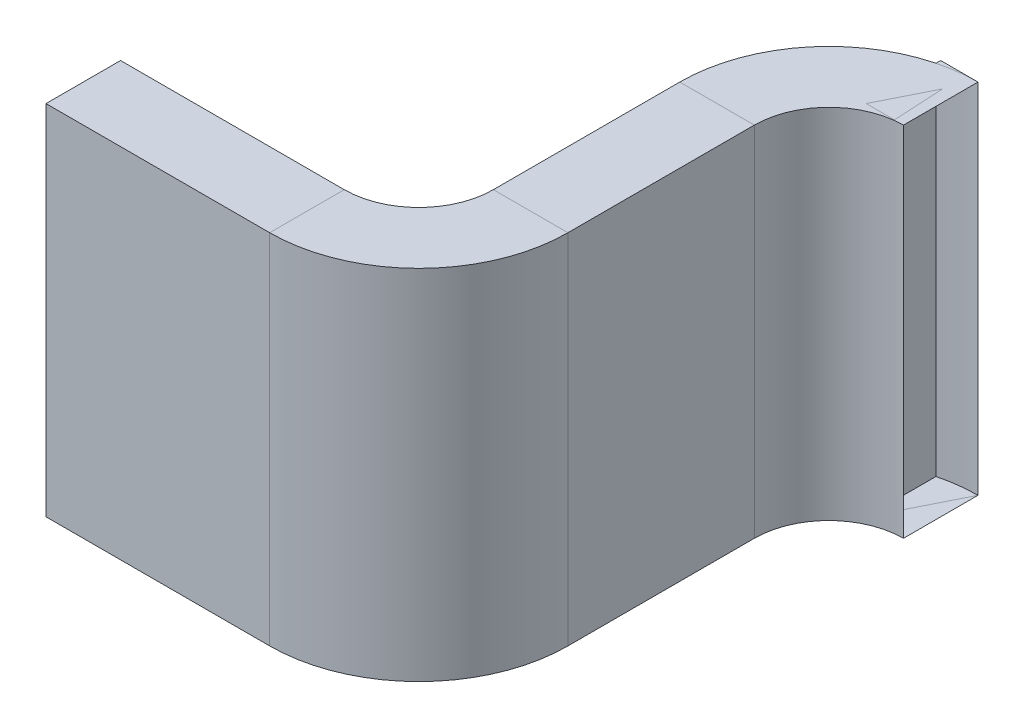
ISO-10303-21;
HEADER;
FILE_DESCRIPTION(('STEP AP214'),'2;1');
FILE_NAME('part.step','',(''),(''),'','','');
FILE_SCHEMA(('AUTOMOTIVE_DESIGN { 1 0 10303 214 1 1 1 1 }'));
ENDSEC;
DATA;
#1=APPLICATION_CONTEXT('core data for automotive mechanical design processes');
#2=APPLICATION_PROTOCOL_DEFINITION('international standard','automotive_design',2000,#1);
#3=PRODUCT_CONTEXT('',#1,'mechanical');
#4=PRODUCT('Part','Part','',(#3));
#5=PRODUCT_RELATED_PRODUCT_CATEGORY('part','',(#4));
#6=PRODUCT_DEFINITION_FORMATION('','',#4);
#7=PRODUCT_DEFINITION_CONTEXT('part definition',#1,'design');
#8=PRODUCT_DEFINITION('design','',#6,#7);
#9=PRODUCT_DEFINITION_SHAPE('','',#8);
#10=(LENGTH_UNIT() NAMED_UNIT(*) SI_UNIT(.MILLI.,.METRE.));
#11=(NAMED_UNIT(*) PLANE_ANGLE_UNIT() SI_UNIT($,.RADIAN.));
#12=(NAMED_UNIT(*) SI_UNIT($,.STERADIAN.) SOLID_ANGLE_UNIT());
#13=UNCERTAINTY_MEASURE_WITH_UNIT(LENGTH_MEASURE(1.E-05),#10,'distance_accuracy_value','');
#14=(GEOMETRIC_REPRESENTATION_CONTEXT(3) GLOBAL_UNCERTAINTY_ASSIGNED_CONTEXT((#13)) GLOBAL_UNIT_ASSIGNED_CONTEXT((#10,
#11,#12)) REPRESENTATION_CONTEXT('',''));
#15=CARTESIAN_POINT('',(0.,0.,0.));
#16=DIRECTION('',(0.,0.,1.));
#17=DIRECTION('',(1.,0.,0.));
#18=AXIS2_PLACEMENT_3D('',#15,#16,#17);
#19=CARTESIAN_POINT('',(0.55,-0.24,0.));
#20=DIRECTION('',(-1.,0.,0.));
#21=DIRECTION('',(0.,1.,0.));
#22=AXIS2_PLACEMENT_3D('',#19,#20,#21);
#23=PLANE('',#22);
#24=DIRECTION('',(0.,-1.,0.));
#25=VECTOR('',#24,1.);
#26=CARTESIAN_POINT('',(0.55,-0.24,0.));
#27=LINE('',#26,#25);
#28=CARTESIAN_POINT('',(0.55,0.24,0.));
#29=VERTEX_POINT('',#28);
#30=CARTESIAN_POINT('',(0.55,-0.24,0.));
#31=VERTEX_POINT('',#30);
#32=EDGE_CURVE('E183',#29,#31,#27,.T.);
#33=ORIENTED_EDGE('',*,*,#32,.F.);
#34=DIRECTION('',(0.,0.,-1.));
#35=VECTOR('',#34,1.);
#36=CARTESIAN_POINT('',(0.55,0.24,0.));
#37=LINE('',#36,#35);
#38=CARTESIAN_POINT('',(0.55,0.24,0.1));
#39=VERTEX_POINT('',#38);
#40=EDGE_CURVE('E11',#39,#29,#37,.T.);
#41=ORIENTED_EDGE('',*,*,#40,.F.);
#42=DIRECTION('',(0.,1.,0.));
#43=VECTOR('',#42,1.);
#44=CARTESIAN_POINT('',(0.55,0.24,0.1));
#45=LINE('',#44,#43);
#46=CARTESIAN_POINT('',(0.55,-0.24,0.1));
#47=VERTEX_POINT('',#46);
#48=EDGE_CURVE('E289',#47,#39,#45,.T.);
#49=ORIENTED_EDGE('',*,*,#48,.F.);
#50=DIRECTION('',(0.,0.,1.));
#51=VECTOR('',#50,1.);
#52=CARTESIAN_POINT('',(0.55,-0.24,0.1));
#53=LINE('',#52,#51);
#54=EDGE_CURVE('E222',#31,#47,#53,.T.);
#55=ORIENTED_EDGE('',*,*,#54,.F.);
#56=EDGE_LOOP('',(#33,#41,#49,#55));
#57=FACE_BOUND('',#56,.T.);
#58=ADVANCED_FACE('F17',(#57),#23,.F.);
#59=CARTESIAN_POINT('',(0.6,0.24,0.));
#60=DIRECTION('',(0.,1.,0.));
#61=DIRECTION('',(1.,0.,0.));
#62=AXIS2_PLACEMENT_3D('',#59,#60,#61);
#63=PLANE('',#62);
#64=ORIENTED_EDGE('',*,*,#40,.T.);
#65=DIRECTION('',(-1.,0.,0.));
#66=VECTOR('',#65,1.);
#67=CARTESIAN_POINT('',(0.6,0.24,0.));
#68=LINE('',#67,#66);
#69=CARTESIAN_POINT('',(0.6,0.24,0.));
#70=VERTEX_POINT('',#69);
#71=EDGE_CURVE('E229',#70,#29,#68,.T.);
#72=ORIENTED_EDGE('',*,*,#71,.F.);
#73=DIRECTION('',(0.,0.,-1.));
#74=VECTOR('',#73,1.);
#75=CARTESIAN_POINT('',(0.6,0.24,0.));
#76=LINE('',#75,#74);
#77=CARTESIAN_POINT('',(0.6,0.24,0.1));
#78=VERTEX_POINT('',#77);
#79=EDGE_CURVE('E25',#78,#70,#76,.T.);
#80=ORIENTED_EDGE('',*,*,#79,.F.);
#81=DIRECTION('',(-1.,0.,0.));
#82=VECTOR('',#81,1.);
#83=CARTESIAN_POINT('',(0.6,0.24,0.1));
#84=LINE('',#83,#82);
#85=EDGE_CURVE('E175',#78,#39,#84,.T.);
#86=ORIENTED_EDGE('',*,*,#85,.T.);
#87=EDGE_LOOP('',(#64,#72,#80,#86));
#88=FACE_BOUND('',#87,.T.);
#89=ADVANCED_FACE('F308',(#88),#63,.F.);
#90=CARTESIAN_POINT('',(0.493933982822,0.24,0.09393398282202));
#91=DIRECTION('',(0.,1.,0.));
#92=DIRECTION('',(1.,0.,0.));
#93=AXIS2_PLACEMENT_3D('',#90,#91,#92);
#94=PLANE('',#93);
#95=CARTESIAN_POINT('',(0.6,0.24,0.2));
#96=DIRECTION('',(0.,-1.,0.));
#97=DIRECTION('',(0.,0.,-1.));
#98=AXIS2_PLACEMENT_3D('',#95,#96,#97);
#99=CIRCLE('',#98,0.1);
#100=CARTESIAN_POINT('',(0.5,0.24,0.2));
#101=VERTEX_POINT('',#100);
#102=EDGE_CURVE('E285',#101,#78,#99,.T.);
#103=ORIENTED_EDGE('',*,*,#102,.T.);
#104=ORIENTED_EDGE('',*,*,#79,.T.);
#105=CARTESIAN_POINT('',(0.6,0.24,0.2));
#106=DIRECTION('',(0.,-1.,0.));
#107=DIRECTION('',(0.,0.,-1.));
#108=AXIS2_PLACEMENT_3D('',#105,#106,#107);
#109=CIRCLE('',#108,0.2);
#110=CARTESIAN_POINT('',(0.4,0.24,0.2));
#111=VERTEX_POINT('',#110);
#112=EDGE_CURVE('E189',#111,#70,#109,.T.);
#113=ORIENTED_EDGE('',*,*,#112,.F.);
#114=DIRECTION('',(-1.,0.,0.));
#115=VECTOR('',#114,1.);
#116=CARTESIAN_POINT('',(0.4,0.24,0.2));
#117=LINE('',#116,#115);
#118=EDGE_CURVE('E297',#101,#111,#117,.T.);
#119=ORIENTED_EDGE('',*,*,#118,.F.);
#120=EDGE_LOOP('',(#103,#104,#113,#119));
#121=FACE_BOUND('',#120,.T.);
#122=ADVANCED_FACE('F304',(#121),#94,.T.);
#123=CARTESIAN_POINT('',(0.4,0.24,0.45));
#124=DIRECTION('',(0.,-1.,0.));
#125=DIRECTION('',(0.,0.,-1.));
#126=AXIS2_PLACEMENT_3D('',#123,#124,#125);
#127=PLANE('',#126);
#128=ORIENTED_EDGE('',*,*,#118,.T.);
#129=DIRECTION('',(0.,0.,-1.));
#130=VECTOR('',#129,1.);
#131=CARTESIAN_POINT('',(0.4,0.24,0.45));
#132=LINE('',#131,#130);
#133=CARTESIAN_POINT('',(0.4,0.24,0.45));
#134=VERTEX_POINT('',#133);
#135=EDGE_CURVE('E194',#134,#111,#132,.T.);
#136=ORIENTED_EDGE('',*,*,#135,.F.);
#137=DIRECTION('',(-1.,0.,0.));
#138=VECTOR('',#137,1.);
#139=CARTESIAN_POINT('',(0.4,0.24,0.45));
#140=LINE('',#139,#138);
#141=CARTESIAN_POINT('',(0.5,0.24,0.45));
#142=VERTEX_POINT('',#141);
#143=EDGE_CURVE('E174',#142,#134,#140,.T.);
#144=ORIENTED_EDGE('',*,*,#143,.F.);
#145=DIRECTION('',(0.,0.,-1.));
#146=VECTOR('',#145,1.);
#147=CARTESIAN_POINT('',(0.5,0.24,0.45));
#148=LINE('',#147,#146);
#149=EDGE_CURVE('E278',#142,#101,#148,.T.);
#150=ORIENTED_EDGE('',*,*,#149,.T.);
#151=EDGE_LOOP('',(#128,#136,#144,#150));
#152=FACE_BOUND('',#151,.T.);
#153=ADVANCED_FACE('F325',(#152),#127,.F.);
#154=CARTESIAN_POINT('',(0.406066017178,0.24,0.556066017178));
#155=DIRECTION('',(0.,1.,0.));
#156=DIRECTION('',(1.,0.,0.));
#157=AXIS2_PLACEMENT_3D('',#154,#155,#156);
#158=PLANE('',#157);
#159=CARTESIAN_POINT('',(0.3,0.24,0.45));
#160=DIRECTION('',(0.,1.,0.));
#161=DIRECTION('',(0.,0.,-1.));
#162=AXIS2_PLACEMENT_3D('',#159,#160,#161);
#163=CIRCLE('',#162,0.2);
#164=CARTESIAN_POINT('',(0.3,0.24,0.65));
#165=VERTEX_POINT('',#164);
#166=EDGE_CURVE('E270',#165,#142,#163,.T.);
#167=ORIENTED_EDGE('',*,*,#166,.T.);
#168=ORIENTED_EDGE('',*,*,#143,.T.);
#169=CARTESIAN_POINT('',(0.3,0.24,0.45));
#170=DIRECTION('',(0.,1.,0.));
#171=DIRECTION('',(0.,0.,-1.));
#172=AXIS2_PLACEMENT_3D('',#169,#170,#171);
#173=CIRCLE('',#172,0.1);
#174=CARTESIAN_POINT('',(0.3,0.24,0.55));
#175=VERTEX_POINT('',#174);
#176=EDGE_CURVE('E205',#175,#134,#173,.T.);
#177=ORIENTED_EDGE('',*,*,#176,.F.);
#178=DIRECTION('',(0.,0.,-1.));
#179=VECTOR('',#178,1.);
#180=CARTESIAN_POINT('',(0.3,0.24,0.55));
#181=LINE('',#180,#179);
#182=EDGE_CURVE('E171',#165,#175,#181,.T.);
#183=ORIENTED_EDGE('',*,*,#182,.F.);
#184=EDGE_LOOP('',(#167,#168,#177,#183));
#185=FACE_BOUND('',#184,.T.);
#186=ADVANCED_FACE('F332',(#185),#158,.T.);
#187=CARTESIAN_POINT('',(0.,0.24,0.55));
#188=DIRECTION('',(0.,-1.,0.));
#189=DIRECTION('',(0.,0.,-1.));
#190=AXIS2_PLACEMENT_3D('',#187,#188,#189);
#191=PLANE('',#190);
#192=ORIENTED_EDGE('',*,*,#182,.T.);
#193=DIRECTION('',(1.,0.,0.));
#194=VECTOR('',#193,1.);
#195=CARTESIAN_POINT('',(0.,0.24,0.55));
#196=LINE('',#195,#194);
#197=CARTESIAN_POINT('',(0.,0.24,0.55));
#198=VERTEX_POINT('',#197);
#199=EDGE_CURVE('E146',#198,#175,#196,.T.);
#200=ORIENTED_EDGE('',*,*,#199,.F.);
#201=DIRECTION('',(0.,0.,-1.));
#202=VECTOR('',#201,1.);
#203=CARTESIAN_POINT('',(0.,0.24,0.55));
#204=LINE('',#203,#202);
#205=CARTESIAN_POINT('',(0.,0.24,0.65));
#206=VERTEX_POINT('',#205);
#207=EDGE_CURVE('E154',#206,#198,#204,.T.);
#208=ORIENTED_EDGE('',*,*,#207,.F.);
#209=DIRECTION('',(1.,0.,0.));
#210=VECTOR('',#209,1.);
#211=CARTESIAN_POINT('',(0.,0.24,0.65));
#212=LINE('',#211,#210);
#213=EDGE_CURVE('E262',#206,#165,#212,.T.);
#214=ORIENTED_EDGE('',*,*,#213,.T.);
#215=EDGE_LOOP('',(#192,#200,#208,#214));
#216=FACE_BOUND('',#215,.T.);
#217=ADVANCED_FACE('F335',(#216),#191,.F.);
#218=CARTESIAN_POINT('',(0.6,0.24,0.1));
#219=DIRECTION('',(0.,0.,1.));
#220=DIRECTION('',(1.,0.,0.));
#221=AXIS2_PLACEMENT_3D('',#218,#219,#220);
#222=PLANE('',#221);
#223=ORIENTED_EDGE('',*,*,#48,.T.);
#224=ORIENTED_EDGE('',*,*,#85,.F.);
#225=DIRECTION('',(0.,-1.,0.));
#226=VECTOR('',#225,1.);
#227=CARTESIAN_POINT('',(0.6,0.24,0.1));
#228=LINE('',#227,#226);
#229=CARTESIAN_POINT('',(0.6,-0.24,0.1));
#230=VERTEX_POINT('',#229);
#231=EDGE_CURVE('E282',#78,#230,#228,.T.);
#232=ORIENTED_EDGE('',*,*,#231,.T.);
#233=DIRECTION('',(-1.,0.,0.));
#234=VECTOR('',#233,1.);
#235=CARTESIAN_POINT('',(0.6,-0.24,0.1));
#236=LINE('',#235,#234);
#237=EDGE_CURVE('E217',#230,#47,#236,.T.);
#238=ORIENTED_EDGE('',*,*,#237,.T.);
#239=EDGE_LOOP('',(#223,#224,#232,#238));
#240=FACE_BOUND('',#239,.T.);
#241=ADVANCED_FACE('F357',(#240),#222,.F.);
#242=CARTESIAN_POINT('',(0.6,0.24,0.2));
#243=DIRECTION('',(0.,-1.,0.));
#244=DIRECTION('',(0.,0.,-1.));
#245=AXIS2_PLACEMENT_3D('',#242,#243,#244);
#246=CYLINDRICAL_SURFACE('',#245,0.1);
#247=ORIENTED_EDGE('',*,*,#231,.F.);
#248=ORIENTED_EDGE('',*,*,#102,.F.);
#249=DIRECTION('',(0.,1.,0.));
#250=VECTOR('',#249,1.);
#251=CARTESIAN_POINT('',(0.5,0.24,0.2));
#252=LINE('',#251,#250);
#253=CARTESIAN_POINT('',(0.5,-0.24,0.2));
#254=VERTEX_POINT('',#253);
#255=EDGE_CURVE('E274',#254,#101,#252,.T.);
#256=ORIENTED_EDGE('',*,*,#255,.F.);
#257=CARTESIAN_POINT('',(0.6,-0.24,0.2));
#258=DIRECTION('',(0.,-1.,0.));
#259=DIRECTION('',(0.,0.,-1.));
#260=AXIS2_PLACEMENT_3D('',#257,#258,#259);
#261=CIRCLE('',#260,0.1);
#262=EDGE_CURVE('E252',#254,#230,#261,.T.);
#263=ORIENTED_EDGE('',*,*,#262,.T.);
#264=EDGE_LOOP('',(#247,#248,#256,#263));
#265=FACE_BOUND('',#264,.T.);
#266=ADVANCED_FACE('F350',(#265),#246,.F.);
#267=CARTESIAN_POINT('',(0.5,0.24,0.45));
#268=DIRECTION('',(-1.,0.,0.));
#269=DIRECTION('',(0.,0.,1.));
#270=AXIS2_PLACEMENT_3D('',#267,#268,#269);
#271=PLANE('',#270);
#272=ORIENTED_EDGE('',*,*,#255,.T.);
#273=ORIENTED_EDGE('',*,*,#149,.F.);
#274=DIRECTION('',(0.,1.,0.));
#275=VECTOR('',#274,1.);
#276=CARTESIAN_POINT('',(0.5,0.24,0.45));
#277=LINE('',#276,#275);
#278=CARTESIAN_POINT('',(0.5,-0.24,0.45));
#279=VERTEX_POINT('',#278);
#280=EDGE_CURVE('E266',#279,#142,#277,.T.);
#281=ORIENTED_EDGE('',*,*,#280,.F.);
#282=DIRECTION('',(0.,0.,-1.));
#283=VECTOR('',#282,1.);
#284=CARTESIAN_POINT('',(0.5,-0.24,0.45));
#285=LINE('',#284,#283);
#286=EDGE_CURVE('E195',#279,#254,#285,.T.);
#287=ORIENTED_EDGE('',*,*,#286,.T.);
#288=EDGE_LOOP('',(#272,#273,#281,#287));
#289=FACE_BOUND('',#288,.T.);
#290=ADVANCED_FACE('F347',(#289),#271,.F.);
#291=CARTESIAN_POINT('',(0.3,0.24,0.45));
#292=DIRECTION('',(0.,1.,0.));
#293=DIRECTION('',(0.,0.,-1.));
#294=AXIS2_PLACEMENT_3D('',#291,#292,#293);
#295=CYLINDRICAL_SURFACE('',#294,0.2);
#296=CARTESIAN_POINT('',(0.3,-0.24,0.45));
#297=DIRECTION('',(0.,1.,0.));
#298=DIRECTION('',(0.,0.,-1.));
#299=AXIS2_PLACEMENT_3D('',#296,#297,#298);
#300=CIRCLE('',#299,0.2);
#301=CARTESIAN_POINT('',(0.3,-0.24,0.65));
#302=VERTEX_POINT('',#301);
#303=EDGE_CURVE('E242',#302,#279,#300,.T.);
#304=ORIENTED_EDGE('',*,*,#303,.T.);
#305=ORIENTED_EDGE('',*,*,#280,.T.);
#306=ORIENTED_EDGE('',*,*,#166,.F.);
#307=DIRECTION('',(0.,1.,0.));
#308=VECTOR('',#307,1.);
#309=CARTESIAN_POINT('',(0.3,0.24,0.65));
#310=LINE('',#309,#308);
#311=EDGE_CURVE('E221',#302,#165,#310,.T.);
#312=ORIENTED_EDGE('',*,*,#311,.F.);
#313=EDGE_LOOP('',(#304,#305,#306,#312));
#314=FACE_BOUND('',#313,.T.);
#315=ADVANCED_FACE('F340',(#314),#295,.T.);
#316=CARTESIAN_POINT('',(0.,0.24,0.65));
#317=DIRECTION('',(0.,0.,-1.));
#318=DIRECTION('',(0.,-1.,0.));
#319=AXIS2_PLACEMENT_3D('',#316,#317,#318);
#320=PLANE('',#319);
#321=ORIENTED_EDGE('',*,*,#311,.T.);
#322=ORIENTED_EDGE('',*,*,#213,.F.);
#323=DIRECTION('',(0.,1.,0.));
#324=VECTOR('',#323,1.);
#325=CARTESIAN_POINT('',(0.,0.24,0.65));
#326=LINE('',#325,#324);
#327=CARTESIAN_POINT('',(0.,-0.24,0.65));
#328=VERTEX_POINT('',#327);
#329=EDGE_CURVE('E162',#328,#206,#326,.T.);
#330=ORIENTED_EDGE('',*,*,#329,.F.);
#331=DIRECTION('',(1.,0.,0.));
#332=VECTOR('',#331,1.);
#333=CARTESIAN_POINT('',(0.,-0.24,0.65));
#334=LINE('',#333,#332);
#335=EDGE_CURVE('E159',#328,#302,#334,.T.);
#336=ORIENTED_EDGE('',*,*,#335,.T.);
#337=EDGE_LOOP('',(#321,#322,#330,#336));
#338=FACE_BOUND('',#337,.T.);
#339=ADVANCED_FACE('F337',(#338),#320,.F.);
#340=CARTESIAN_POINT('',(0.6,-0.24,0.1));
#341=DIRECTION('',(0.,-1.,0.));
#342=DIRECTION('',(0.,0.,-1.));
#343=AXIS2_PLACEMENT_3D('',#340,#341,#342);
#344=PLANE('',#343);
#345=ORIENTED_EDGE('',*,*,#54,.T.);
#346=ORIENTED_EDGE('',*,*,#237,.F.);
#347=DIRECTION('',(0.,0.,1.));
#348=VECTOR('',#347,1.);
#349=CARTESIAN_POINT('',(0.6,-0.24,0.1));
#350=LINE('',#349,#348);
#351=CARTESIAN_POINT('',(0.6,-0.24,0.));
#352=VERTEX_POINT('',#351);
#353=EDGE_CURVE('E199',#352,#230,#350,.T.);
#354=ORIENTED_EDGE('',*,*,#353,.F.);
#355=DIRECTION('',(-1.,0.,0.));
#356=VECTOR('',#355,1.);
#357=CARTESIAN_POINT('',(0.6,-0.24,0.));
#358=LINE('',#357,#356);
#359=EDGE_CURVE('E186',#352,#31,#358,.T.);
#360=ORIENTED_EDGE('',*,*,#359,.T.);
#361=EDGE_LOOP('',(#345,#346,#354,#360));
#362=FACE_BOUND('',#361,.T.);
#363=ADVANCED_FACE('F355',(#362),#344,.F.);
#364=CARTESIAN_POINT('',(0.493933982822,-0.24,0.09393398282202));
#365=DIRECTION('',(0.,-1.,0.));
#366=DIRECTION('',(0.,0.,-1.));
#367=AXIS2_PLACEMENT_3D('',#364,#365,#366);
#368=PLANE('',#367);
#369=CARTESIAN_POINT('',(0.6,-0.24,0.2));
#370=DIRECTION('',(0.,-1.,0.));
#371=DIRECTION('',(0.,0.,-1.));
#372=AXIS2_PLACEMENT_3D('',#369,#370,#371);
#373=CIRCLE('',#372,0.2);
#374=CARTESIAN_POINT('',(0.4,-0.24,0.2));
#375=VERTEX_POINT('',#374);
#376=EDGE_CURVE('E187',#375,#352,#373,.T.);
#377=ORIENTED_EDGE('',*,*,#376,.T.);
#378=ORIENTED_EDGE('',*,*,#353,.T.);
#379=ORIENTED_EDGE('',*,*,#262,.F.);
#380=DIRECTION('',(1.,0.,0.));
#381=VECTOR('',#380,1.);
#382=CARTESIAN_POINT('',(0.5,-0.24,0.2));
#383=LINE('',#382,#381);
#384=EDGE_CURVE('E200',#375,#254,#383,.T.);
#385=ORIENTED_EDGE('',*,*,#384,.F.);
#386=EDGE_LOOP('',(#377,#378,#379,#385));
#387=FACE_BOUND('',#386,.T.);
#388=ADVANCED_FACE('F352',(#387),#368,.T.);
#389=CARTESIAN_POINT('',(0.5,-0.24,0.45));
#390=DIRECTION('',(0.,1.,0.));
#391=DIRECTION('',(1.,0.,0.));
#392=AXIS2_PLACEMENT_3D('',#389,#390,#391);
#393=PLANE('',#392);
#394=ORIENTED_EDGE('',*,*,#384,.T.);
#395=ORIENTED_EDGE('',*,*,#286,.F.);
#396=DIRECTION('',(1.,0.,0.));
#397=VECTOR('',#396,1.);
#398=CARTESIAN_POINT('',(0.5,-0.24,0.45));
#399=LINE('',#398,#397);
#400=CARTESIAN_POINT('',(0.4,-0.24,0.45));
#401=VERTEX_POINT('',#400);
#402=EDGE_CURVE('E238',#401,#279,#399,.T.);
#403=ORIENTED_EDGE('',*,*,#402,.F.);
#404=DIRECTION('',(0.,0.,-1.));
#405=VECTOR('',#404,1.);
#406=CARTESIAN_POINT('',(0.4,-0.24,0.45));
#407=LINE('',#406,#405);
#408=EDGE_CURVE('E216',#401,#375,#407,.T.);
#409=ORIENTED_EDGE('',*,*,#408,.T.);
#410=EDGE_LOOP('',(#394,#395,#403,#409));
#411=FACE_BOUND('',#410,.T.);
#412=ADVANCED_FACE('F345',(#411),#393,.F.);
#413=CARTESIAN_POINT('',(0.406066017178,-0.24,0.556066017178));
#414=DIRECTION('',(0.,-1.,0.));
#415=DIRECTION('',(0.,0.,-1.));
#416=AXIS2_PLACEMENT_3D('',#413,#414,#415);
#417=PLANE('',#416);
#418=CARTESIAN_POINT('',(0.3,-0.24,0.45));
#419=DIRECTION('',(0.,1.,0.));
#420=DIRECTION('',(0.,0.,-1.));
#421=AXIS2_PLACEMENT_3D('',#418,#419,#420);
#422=CIRCLE('',#421,0.1);
#423=CARTESIAN_POINT('',(0.3,-0.24,0.55));
#424=VERTEX_POINT('',#423);
#425=EDGE_CURVE('E204',#424,#401,#422,.T.);
#426=ORIENTED_EDGE('',*,*,#425,.T.);
#427=ORIENTED_EDGE('',*,*,#402,.T.);
#428=ORIENTED_EDGE('',*,*,#303,.F.);
#429=DIRECTION('',(0.,0.,1.));
#430=VECTOR('',#429,1.);
#431=CARTESIAN_POINT('',(0.3,-0.24,0.65));
#432=LINE('',#431,#430);
#433=EDGE_CURVE('E233',#424,#302,#432,.T.);
#434=ORIENTED_EDGE('',*,*,#433,.F.);
#435=EDGE_LOOP('',(#426,#427,#428,#434));
#436=FACE_BOUND('',#435,.T.);
#437=ADVANCED_FACE('F342',(#436),#417,.T.);
#438=CARTESIAN_POINT('',(0.,-0.24,0.65));
#439=DIRECTION('',(0.,1.,0.));
#440=DIRECTION('',(1.,0.,0.));
#441=AXIS2_PLACEMENT_3D('',#438,#439,#440);
#442=PLANE('',#441);
#443=ORIENTED_EDGE('',*,*,#433,.T.);
#444=ORIENTED_EDGE('',*,*,#335,.F.);
#445=DIRECTION('',(0.,0.,1.));
#446=VECTOR('',#445,1.);
#447=CARTESIAN_POINT('',(0.,-0.24,0.65));
#448=LINE('',#447,#446);
#449=CARTESIAN_POINT('',(0.,-0.24,0.55));
#450=VERTEX_POINT('',#449);
#451=EDGE_CURVE('E152',#450,#328,#448,.T.);
#452=ORIENTED_EDGE('',*,*,#451,.F.);
#453=DIRECTION('',(1.,0.,0.));
#454=VECTOR('',#453,1.);
#455=CARTESIAN_POINT('',(0.,-0.24,0.55));
#456=LINE('',#455,#454);
#457=EDGE_CURVE('E134',#450,#424,#456,.T.);
#458=ORIENTED_EDGE('',*,*,#457,.T.);
#459=EDGE_LOOP('',(#443,#444,#452,#458));
#460=FACE_BOUND('',#459,.T.);
#461=ADVANCED_FACE('F157',(#460),#442,.F.);
#462=CARTESIAN_POINT('',(0.6,-0.24,0.));
#463=DIRECTION('',(0.,0.,-1.));
#464=DIRECTION('',(0.,-1.,0.));
#465=AXIS2_PLACEMENT_3D('',#462,#463,#464);
#466=PLANE('',#465);
#467=ORIENTED_EDGE('',*,*,#32,.T.);
#468=ORIENTED_EDGE('',*,*,#359,.F.);
#469=DIRECTION('',(0.,-1.,0.));
#470=VECTOR('',#469,1.);
#471=CARTESIAN_POINT('',(0.6,-0.24,0.));
#472=LINE('',#471,#470);
#473=EDGE_CURVE('E193',#70,#352,#472,.T.);
#474=ORIENTED_EDGE('',*,*,#473,.F.);
#475=ORIENTED_EDGE('',*,*,#71,.T.);
#476=EDGE_LOOP('',(#467,#468,#474,#475));
#477=FACE_BOUND('',#476,.T.);
#478=ADVANCED_FACE('F311',(#477),#466,.F.);
#479=CARTESIAN_POINT('',(0.6,-0.24,0.2));
#480=DIRECTION('',(0.,-1.,0.));
#481=DIRECTION('',(0.,0.,-1.));
#482=AXIS2_PLACEMENT_3D('',#479,#480,#481);
#483=CYLINDRICAL_SURFACE('',#482,0.2);
#484=ORIENTED_EDGE('',*,*,#112,.T.);
#485=ORIENTED_EDGE('',*,*,#473,.T.);
#486=ORIENTED_EDGE('',*,*,#376,.F.);
#487=DIRECTION('',(0.,-1.,0.));
#488=VECTOR('',#487,1.);
#489=CARTESIAN_POINT('',(0.4,-0.24,0.2));
#490=LINE('',#489,#488);
#491=EDGE_CURVE('E209',#111,#375,#490,.T.);
#492=ORIENTED_EDGE('',*,*,#491,.F.);
#493=EDGE_LOOP('',(#484,#485,#486,#492));
#494=FACE_BOUND('',#493,.T.);
#495=ADVANCED_FACE('F317',(#494),#483,.T.);
#496=CARTESIAN_POINT('',(0.4,-0.24,0.45));
#497=DIRECTION('',(1.,0.,0.));
#498=DIRECTION('',(0.,1.,0.));
#499=AXIS2_PLACEMENT_3D('',#496,#497,#498);
#500=PLANE('',#499);
#501=ORIENTED_EDGE('',*,*,#491,.T.);
#502=ORIENTED_EDGE('',*,*,#408,.F.);
#503=DIRECTION('',(0.,1.,0.));
#504=VECTOR('',#503,1.);
#505=CARTESIAN_POINT('',(0.4,-0.24,0.45));
#506=LINE('',#505,#504);
#507=EDGE_CURVE('E182',#401,#134,#506,.T.);
#508=ORIENTED_EDGE('',*,*,#507,.T.);
#509=ORIENTED_EDGE('',*,*,#135,.T.);
#510=EDGE_LOOP('',(#501,#502,#508,#509));
#511=FACE_BOUND('',#510,.T.);
#512=ADVANCED_FACE('F321',(#511),#500,.F.);
#513=CARTESIAN_POINT('',(0.3,-0.24,0.45));
#514=DIRECTION('',(0.,1.,0.));
#515=DIRECTION('',(0.,0.,-1.));
#516=AXIS2_PLACEMENT_3D('',#513,#514,#515);
#517=CYLINDRICAL_SURFACE('',#516,0.1);
#518=ORIENTED_EDGE('',*,*,#507,.F.);
#519=ORIENTED_EDGE('',*,*,#425,.F.);
#520=DIRECTION('',(0.,-1.,0.));
#521=VECTOR('',#520,1.);
#522=CARTESIAN_POINT('',(0.3,-0.24,0.55));
#523=LINE('',#522,#521);
#524=EDGE_CURVE('E141',#175,#424,#523,.T.);
#525=ORIENTED_EDGE('',*,*,#524,.F.);
#526=ORIENTED_EDGE('',*,*,#176,.T.);
#527=EDGE_LOOP('',(#518,#519,#525,#526));
#528=FACE_BOUND('',#527,.T.);
#529=ADVANCED_FACE('F329',(#528),#517,.F.);
#530=CARTESIAN_POINT('',(0.,-0.24,0.55));
#531=DIRECTION('',(0.,0.,1.));
#532=DIRECTION('',(1.,0.,0.));
#533=AXIS2_PLACEMENT_3D('',#530,#531,#532);
#534=PLANE('',#533);
#535=ORIENTED_EDGE('',*,*,#524,.T.);
#536=ORIENTED_EDGE('',*,*,#457,.F.);
#537=DIRECTION('',(0.,-1.,0.));
#538=VECTOR('',#537,1.);
#539=CARTESIAN_POINT('',(0.,-0.24,0.55));
#540=LINE('',#539,#538);
#541=EDGE_CURVE('E138',#198,#450,#540,.T.);
#542=ORIENTED_EDGE('',*,*,#541,.F.);
#543=ORIENTED_EDGE('',*,*,#199,.T.);
#544=EDGE_LOOP('',(#535,#536,#542,#543));
#545=FACE_BOUND('',#544,.T.);
#546=ADVANCED_FACE('F136',(#545),#534,.F.);
#547=CARTESIAN_POINT('',(0.,-0.24,0.55));
#548=DIRECTION('',(-1.,0.,0.));
#549=DIRECTION('',(0.,0.,1.));
#550=AXIS2_PLACEMENT_3D('',#547,#548,#549);
#551=PLANE('',#550);
#552=ORIENTED_EDGE('',*,*,#451,.T.);
#553=ORIENTED_EDGE('',*,*,#329,.T.);
#554=ORIENTED_EDGE('',*,*,#207,.T.);
#555=ORIENTED_EDGE('',*,*,#541,.T.);
#556=EDGE_LOOP('',(#552,#553,#554,#555));
#557=FACE_BOUND('',#556,.T.);
#558=ADVANCED_FACE('F150',(#557),#551,.T.);
#559=CLOSED_SHELL('',(#58,#89,#122,#153,#186,#217,#241,#266,#290,#315,#339,#363,#388,#412,#437,
#461,#478,#495,#512,#529,#546,#558));
#560=MANIFOLD_SOLID_BREP('B1',#559);
#561=ADVANCED_BREP_SHAPE_REPRESENTATION('',(#18,#560),#14);
#562=SHAPE_DEFINITION_REPRESENTATION(#9,#561);
ENDSEC;
END-ISO-10303-21;
